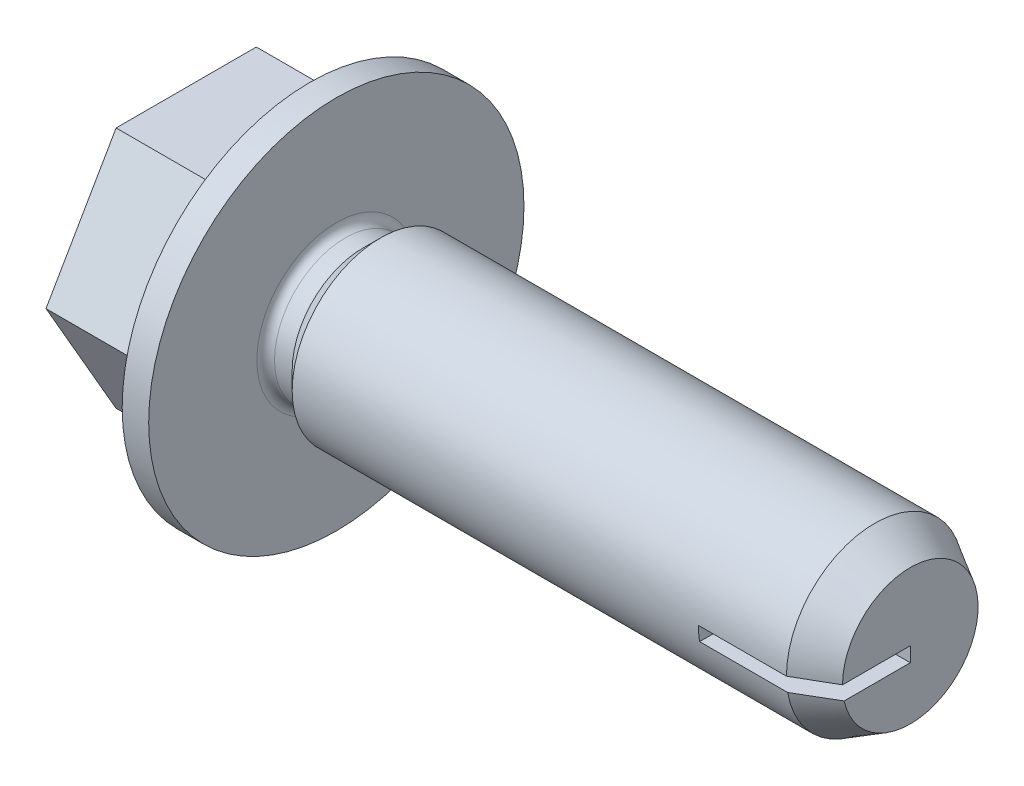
from build123d import *

# Parameters (mm, degrees)
EXTRUDE1_REACH           = 19.467
SKETCH11_W               = 2.8
SKETCH11_H               = 0.333333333
POINT_CUT_EXTRUDE8_DEPTH = 15.322185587
SKETCH16_R               = 2.2
CUT_EXTRUDE1_DEPTH       = 0.56


with BuildPart() as part:
    # Sketch1 → base-Revolve (revolve)
    with BuildSketch(Plane.XY, mode=Mode.PRIVATE) as base_revolve_sk:
        with BuildLine():
            Line((0, 4.25), (-0.6, 4.25))
            Line((-0.6, 4.25), (-1.087379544, 2.75))
            Line((-1.087379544, 2.75), (-3.4, 2.75))
            Line((-3.4, 2.75), (-3.4, 0))
            Line((-3.4, 0), (-2.84, 0))
            Line((-2.84, 0), (0, 0))
            Line((0, 0), (13, 0))
            Line((13, 0), (13, 2))
            Line((13, 2), (1, 2))
            Line((1, 2), (0.6, 1.6))
            Line((0.6, 1.6), (0.2, 1.6))
            ThreePointArc((0.2, 1.6), (0.058578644, 1.658578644), (0, 1.8))
            Line((0, 1.8), (0, 4.25))
        make_face()
    revolve(base_revolve_sk.sketch.rotate(Axis((0, 0, 0), (1, 0, 0)), 90), axis=Axis((0, 0, 0), (1, 0, 0)))

    # Extrude1: up to this cone (the profile starts outside it)
    extrude1_end = Plane(origin=(-3.4, 0, 0), z_dir=(1, 0, 0)).offset(1.419092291) * Cone(3.078e-06, 57.084593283, 18.547907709, align=(Align.CENTER, Align.CENTER, Align.MIN), mode=Mode.PRIVATE)
    # Sketch15 → Extrude1 (add, up to the surface)
    with BuildSketch(Plane.ZY.offset(3.4), mode=Mode.PRIVATE) as extrude1_sk1:
        Polygon((-1.58771324, 2.75), (-3.175426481, 0), (-1.58771324, -2.75), (1.58771324, -2.75), (3.175426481, 0), (1.58771324, 2.75), align=None)
    extrude1_tool1 = extrude(extrude1_sk1.sketch, amount=-EXTRUDE1_REACH, mode=Mode.PRIVATE) - extrude1_end
    add(extrude1_tool1.solids().sort_by_distance((-3.4, 0, 0))[0])

    # Sketch8 → point_Cut-Revolve1 (revolve, cut)
    with BuildSketch(Plane.XY, mode=Mode.PRIVATE) as point_cut_revolve1_sk:
        Polygon((13, 0), (13.508, 0), (13.508, 2.508), (12.194596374, 2.508), (12.194596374, 2), (13, 1.535), align=None)
    revolve(point_cut_revolve1_sk.sketch.rotate(Axis((0, 0, 0), (1, 0, 0)), 90), axis=Axis((0, 0, 0), (1, 0, 0)), mode=Mode.SUBTRACT)

    # Sketch11 → point_Cut-Extrude8 (cut, through all)
    with BuildSketch(Plane.XY):
        with Locations((11.6, -0.166666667)):
            Rectangle(SKETCH11_W, SKETCH11_H)
    extrude(amount=POINT_CUT_EXTRUDE8_DEPTH, mode=Mode.SUBTRACT)

    # Sketch16 → Cut-Extrude1 (cut)
    with BuildSketch(Plane.ZY.offset(3.4)):
        Circle(SKETCH16_R)
    extrude(amount=-CUT_EXTRUDE1_DEPTH, mode=Mode.SUBTRACT)


solid = part.part
